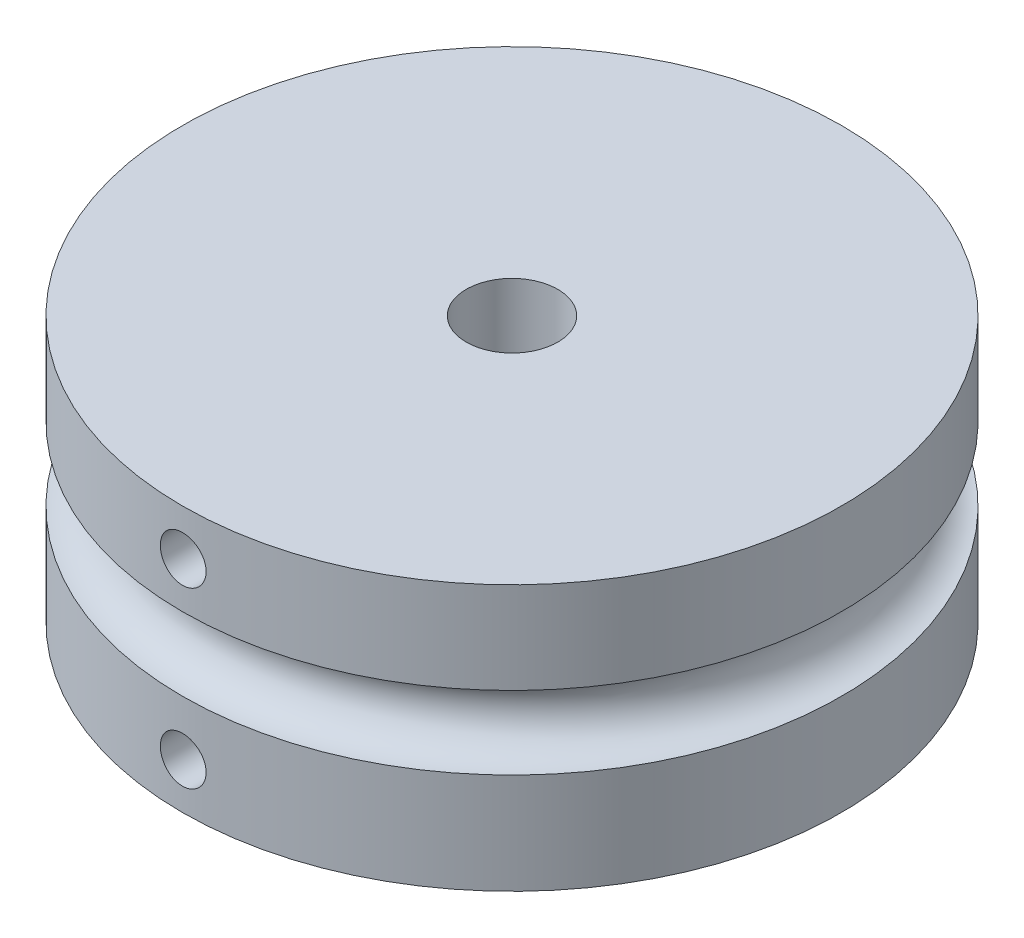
ISO-10303-21;
HEADER;
FILE_DESCRIPTION(('STEP AP214'),'2;1');
FILE_NAME('part.step','',(''),(''),'','','');
FILE_SCHEMA(('AUTOMOTIVE_DESIGN { 1 0 10303 214 1 1 1 1 }'));
ENDSEC;
DATA;
#1=APPLICATION_CONTEXT('core data for automotive mechanical design processes');
#2=APPLICATION_PROTOCOL_DEFINITION('international standard','automotive_design',2000,#1);
#3=PRODUCT_CONTEXT('',#1,'mechanical');
#4=PRODUCT('Part','Part','',(#3));
#5=PRODUCT_RELATED_PRODUCT_CATEGORY('part','',(#4));
#6=PRODUCT_DEFINITION_FORMATION('','',#4);
#7=PRODUCT_DEFINITION_CONTEXT('part definition',#1,'design');
#8=PRODUCT_DEFINITION('design','',#6,#7);
#9=PRODUCT_DEFINITION_SHAPE('','',#8);
#10=(LENGTH_UNIT() NAMED_UNIT(*) SI_UNIT(.MILLI.,.METRE.));
#11=(NAMED_UNIT(*) PLANE_ANGLE_UNIT() SI_UNIT($,.RADIAN.));
#12=(NAMED_UNIT(*) SI_UNIT($,.STERADIAN.) SOLID_ANGLE_UNIT());
#13=UNCERTAINTY_MEASURE_WITH_UNIT(LENGTH_MEASURE(1.E-05),#10,'distance_accuracy_value','');
#14=(GEOMETRIC_REPRESENTATION_CONTEXT(3) GLOBAL_UNCERTAINTY_ASSIGNED_CONTEXT((#13)) GLOBAL_UNIT_ASSIGNED_CONTEXT((#10,
#11,#12)) REPRESENTATION_CONTEXT('',''));
#15=CARTESIAN_POINT('',(0.,0.,0.));
#16=DIRECTION('',(0.,0.,1.));
#17=DIRECTION('',(1.,0.,0.));
#18=AXIS2_PLACEMENT_3D('',#15,#16,#17);
#19=CARTESIAN_POINT('',(0.,7.25,0.));
#20=DIRECTION('',(0.,-1.,0.));
#21=DIRECTION('',(0.,0.,-1.));
#22=AXIS2_PLACEMENT_3D('',#19,#20,#21);
#23=CYLINDRICAL_SURFACE('',#22,18.);
#24=CARTESIAN_POINT('',(0.,3.50000000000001,18.));
#25=CARTESIAN_POINT('',(-0.0701223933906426,3.50000307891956,17.9999994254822));
#26=CARTESIAN_POINT('',(-0.140293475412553,3.50592041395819,17.9995858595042));
#27=CARTESIAN_POINT('',(-0.278696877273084,3.52944024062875,17.9979758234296));
#28=CARTESIAN_POINT('',(-0.346926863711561,3.54705622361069,17.9967784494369));
#29=CARTESIAN_POINT('',(-0.479423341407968,3.59346388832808,17.9937362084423));
#30=CARTESIAN_POINT('',(-0.543691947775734,3.62224954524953,17.9918916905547));
#31=CARTESIAN_POINT('',(-0.666468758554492,3.69016935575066,17.9877624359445));
#32=CARTESIAN_POINT('',(-0.7249782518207,3.7293011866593,17.985477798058));
#33=CARTESIAN_POINT('',(-0.834698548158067,3.8168799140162,17.9807203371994));
#34=CARTESIAN_POINT('',(-0.885897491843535,3.86534165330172,17.9782472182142));
#35=CARTESIAN_POINT('',(-0.979441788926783,3.97017363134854,17.9733940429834));
#36=CARTESIAN_POINT('',(-1.02178676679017,4.02654420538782,17.9710139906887));
#37=CARTESIAN_POINT('',(-1.09645909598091,4.14566271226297,17.9666130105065));
#38=CARTESIAN_POINT('',(-1.1287763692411,4.20841697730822,17.9645924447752));
#39=CARTESIAN_POINT('',(-1.18241148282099,4.33847719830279,17.9611422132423));
#40=CARTESIAN_POINT('',(-1.2037294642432,4.40578309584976,17.9597125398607));
#41=CARTESIAN_POINT('',(-1.23472734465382,4.54291988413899,17.9576081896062));
#42=CARTESIAN_POINT('',(-1.24442612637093,4.61274648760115,17.9569322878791));
#43=CARTESIAN_POINT('',(-1.25196859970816,4.75303960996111,17.9564080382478));
#44=CARTESIAN_POINT('',(-1.24981245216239,4.82350612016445,17.9565596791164));
#45=CARTESIAN_POINT('',(-1.23372191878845,4.9629498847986,17.9576722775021));
#46=CARTESIAN_POINT('',(-1.21980799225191,5.03192951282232,17.9586318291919));
#47=CARTESIAN_POINT('',(-1.18062861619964,5.16657180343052,17.9612499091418));
#48=CARTESIAN_POINT('',(-1.15536308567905,5.2322344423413,17.9629084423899));
#49=CARTESIAN_POINT('',(-1.09417456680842,5.3584444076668,17.9667392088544));
#50=CARTESIAN_POINT('',(-1.05824232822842,5.41898723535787,17.9689118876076));
#51=CARTESIAN_POINT('',(-0.97674706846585,5.533189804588,17.9735256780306));
#52=CARTESIAN_POINT('',(-0.931183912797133,5.58684944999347,17.9759667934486));
#53=CARTESIAN_POINT('',(-0.831605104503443,5.68588146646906,17.9808486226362));
#54=CARTESIAN_POINT('',(-0.777571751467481,5.73123604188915,17.9832893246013));
#55=CARTESIAN_POINT('',(-0.662648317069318,5.81223310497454,17.9878903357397));
#56=CARTESIAN_POINT('',(-0.601758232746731,5.84787558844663,17.9900506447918));
#57=CARTESIAN_POINT('',(-0.474838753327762,5.90843532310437,17.9938476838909));
#58=CARTESIAN_POINT('',(-0.408809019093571,5.93335186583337,17.9954843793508));
#59=CARTESIAN_POINT('',(-0.27348954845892,5.97174037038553,17.9980493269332));
#60=CARTESIAN_POINT('',(-0.204199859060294,5.98521249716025,17.9989775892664));
#61=CARTESIAN_POINT('',(-0.0644817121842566,6.00030761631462,18.0000197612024));
#62=CARTESIAN_POINT('',(0.00594407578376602,6.0019552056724,18.0001353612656));
#63=CARTESIAN_POINT('',(0.146070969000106,5.99341879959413,17.9995436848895));
#64=CARTESIAN_POINT('',(0.215772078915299,5.98323488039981,17.9988364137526));
#65=CARTESIAN_POINT('',(0.352401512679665,5.951344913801,17.9966796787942));
#66=CARTESIAN_POINT('',(0.419332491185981,5.92965018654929,17.9952309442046));
#67=CARTESIAN_POINT('',(0.548603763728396,5.87536595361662,17.991754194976));
#68=CARTESIAN_POINT('',(0.6109440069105,5.84277632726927,17.9897261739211));
#69=CARTESIAN_POINT('',(0.729376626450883,5.76756502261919,17.9853143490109));
#70=CARTESIAN_POINT('',(0.785458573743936,5.72492695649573,17.9829299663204));
#71=CARTESIAN_POINT('',(0.889677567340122,5.63085290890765,17.9780755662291));
#72=CARTESIAN_POINT('',(0.937814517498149,5.57941682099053,17.9756055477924));
#73=CARTESIAN_POINT('',(1.02486072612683,5.46910050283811,17.9708533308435));
#74=CARTESIAN_POINT('',(1.06375399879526,5.41020764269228,17.9685714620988));
#75=CARTESIAN_POINT('',(1.13109939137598,5.28671282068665,17.964458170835));
#76=CARTESIAN_POINT('',(1.15955158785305,5.22211090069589,17.9626267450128));
#77=CARTESIAN_POINT('',(1.2051796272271,5.08908961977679,17.959623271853));
#78=CARTESIAN_POINT('',(1.22236544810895,5.02067369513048,17.9584506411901));
#79=CARTESIAN_POINT('',(1.24500545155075,4.88191895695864,17.9568953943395));
#80=CARTESIAN_POINT('',(1.25045978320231,4.81158016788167,17.956512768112));
#81=CARTESIAN_POINT('',(1.24948046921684,4.6711352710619,17.9565809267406));
#82=CARTESIAN_POINT('',(1.24307194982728,4.60102898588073,17.957029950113));
#83=CARTESIAN_POINT('',(1.21860103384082,4.46289060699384,17.9587070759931));
#84=CARTESIAN_POINT('',(1.20053861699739,4.39485851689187,17.9599351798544));
#85=CARTESIAN_POINT('',(1.15327852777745,4.26279663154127,17.9630316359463));
#86=CARTESIAN_POINT('',(1.12408107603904,4.19876675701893,17.9648999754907));
#87=CARTESIAN_POINT('',(1.05538290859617,4.07651419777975,17.9690663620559));
#88=CARTESIAN_POINT('',(1.01588242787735,4.01829138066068,17.9713643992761));
#89=CARTESIAN_POINT('',(0.927605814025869,3.90917770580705,17.9761369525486));
#90=CARTESIAN_POINT('',(0.878811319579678,3.85830171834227,17.9786118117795));
#91=CARTESIAN_POINT('',(0.77336021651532,3.76544424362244,17.9834561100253));
#92=CARTESIAN_POINT('',(0.716701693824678,3.72346492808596,17.9858255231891));
#93=CARTESIAN_POINT('',(0.597053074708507,3.64955401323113,17.990194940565));
#94=CARTESIAN_POINT('',(0.534054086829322,3.61763679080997,17.9921944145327));
#95=CARTESIAN_POINT('',(0.403622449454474,3.56487259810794,17.9955918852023));
#96=CARTESIAN_POINT('',(0.336195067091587,3.54401273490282,17.9969905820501));
#97=CARTESIAN_POINT('',(0.223632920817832,3.51934426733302,17.9986646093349));
#98=CARTESIAN_POINT('',(0.179224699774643,3.51209962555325,17.999163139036));
#99=CARTESIAN_POINT('',(0.0898843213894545,3.50242650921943,17.9998310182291));
#100=CARTESIAN_POINT('',(0.044952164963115,3.49999802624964,18.0000003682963));
#101=CARTESIAN_POINT('',(0.,3.50000000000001,18.));
#102=B_SPLINE_CURVE_WITH_KNOTS('',3,(#24,#25,#26,#27,#28,#29,#30,#31,#32,#33,#34,#35,#36,#37,
#38,#39,#40,#41,#42,#43,#44,#45,#46,#47,#48,#49,#50,#51,#52,#53,#54,#55,#56,#57,#58,#59,#60,#61,
#62,#63,#64,#65,#66,#67,#68,#69,#70,#71,#72,#73,#74,#75,#76,#77,#78,#79,#80,#81,#82,#83,#84,#85,
#86,#87,#88,#89,#90,#91,#92,#93,#94,#95,#96,#97,#98,#99,#100,#101),.UNSPECIFIED.,.T.,.F.,(4,2,2,
2,2,2,2,2,2,2,2,2,2,2,2,2,2,2,2,2,2,2,2,2,2,2,2,2,2,2,2,2,2,2,2,2,2,2,4),(0.,0.210203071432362,
0.420648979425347,0.630981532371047,0.841266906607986,1.05188962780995,1.26252128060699,
1.47336394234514,1.6842038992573,1.89470074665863,2.10519473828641,2.31532320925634,
2.52545317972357,2.73576591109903,2.94608157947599,3.15684275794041,3.36760402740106,
3.57837921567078,3.78915136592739,3.99948494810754,4.20981717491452,4.41994293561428,
4.6300710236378,4.84054420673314,5.05101993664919,5.26185705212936,5.47269262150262,
5.68334121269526,5.89398712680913,6.10418739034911,6.31438801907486,6.52458448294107,
6.73477615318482,6.94538746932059,7.15605013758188,7.36701245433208,7.57772824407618,
7.71247977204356,7.84723106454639),.UNSPECIFIED.);
#103=CARTESIAN_POINT('',(0.,3.50000000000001,18.));
#104=VERTEX_POINT('',#103);
#105=EDGE_CURVE('E93',#104,#104,#102,.T.);
#106=ORIENTED_EDGE('',*,*,#105,.T.);
#107=EDGE_LOOP('',(#106));
#108=FACE_BOUND('',#107,.T.);
#109=CARTESIAN_POINT('',(0.,2.25,0.));
#110=DIRECTION('',(0.,-1.,0.));
#111=DIRECTION('',(0.,0.,-1.));
#112=AXIS2_PLACEMENT_3D('',#109,#110,#111);
#113=CIRCLE('',#112,18.);
#114=CARTESIAN_POINT('',(0.,2.25,-18.));
#115=VERTEX_POINT('',#114);
#116=EDGE_CURVE('E73',#115,#115,#113,.F.);
#117=ORIENTED_EDGE('',*,*,#116,.T.);
#118=EDGE_LOOP('',(#117));
#119=FACE_BOUND('',#118,.T.);
#120=CARTESIAN_POINT('',(0.,7.25,0.));
#121=DIRECTION('',(0.,1.,0.));
#122=DIRECTION('',(0.,0.,1.));
#123=AXIS2_PLACEMENT_3D('',#120,#121,#122);
#124=CIRCLE('',#123,18.);
#125=CARTESIAN_POINT('',(0.,7.25,18.));
#126=VERTEX_POINT('',#125);
#127=EDGE_CURVE('E60',#126,#126,#124,.T.);
#128=ORIENTED_EDGE('',*,*,#127,.F.);
#129=EDGE_LOOP('',(#128));
#130=FACE_BOUND('',#129,.T.);
#131=ADVANCED_FACE('F47',(#108,#119,#130),#23,.T.);
#132=CARTESIAN_POINT('',(0.,7.25,0.));
#133=DIRECTION('',(0.,1.,0.));
#134=DIRECTION('',(0.,0.,1.));
#135=AXIS2_PLACEMENT_3D('',#132,#133,#134);
#136=PLANE('',#135);
#137=CARTESIAN_POINT('',(0.,7.25,0.));
#138=DIRECTION('',(0.,1.,0.));
#139=DIRECTION('',(0.,0.,1.));
#140=AXIS2_PLACEMENT_3D('',#137,#138,#139);
#141=CIRCLE('',#140,2.5);
#142=CARTESIAN_POINT('',(0.,7.25,2.5));
#143=VERTEX_POINT('',#142);
#144=EDGE_CURVE('E112',#143,#143,#141,.T.);
#145=ORIENTED_EDGE('',*,*,#144,.F.);
#146=EDGE_LOOP('',(#145));
#147=FACE_BOUND('',#146,.T.);
#148=ORIENTED_EDGE('',*,*,#127,.T.);
#149=EDGE_LOOP('',(#148));
#150=FACE_BOUND('',#149,.T.);
#151=ADVANCED_FACE('F137',(#147,#150),#136,.T.);
#152=CARTESIAN_POINT('',(0.,0.249999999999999,0.));
#153=DIRECTION('',(0.,1.,0.));
#154=DIRECTION('',(0.,0.,1.));
#155=AXIS2_PLACEMENT_3D('',#152,#153,#154);
#156=TOROIDAL_SURFACE('',#155,18.,2.);
#157=CARTESIAN_POINT('',(0.,-1.75,0.));
#158=DIRECTION('',(0.,1.,0.));
#159=DIRECTION('',(0.,0.,1.));
#160=AXIS2_PLACEMENT_3D('',#157,#158,#159);
#161=CIRCLE('',#160,18.);
#162=CARTESIAN_POINT('',(0.,-1.75,18.));
#163=VERTEX_POINT('',#162);
#164=EDGE_CURVE('E79',#163,#163,#161,.F.);
#165=ORIENTED_EDGE('',*,*,#164,.F.);
#166=EDGE_LOOP('',(#165));
#167=FACE_BOUND('',#166,.T.);
#168=ORIENTED_EDGE('',*,*,#116,.F.);
#169=EDGE_LOOP('',(#168));
#170=FACE_BOUND('',#169,.T.);
#171=ADVANCED_FACE('F142',(#167,#170),#156,.F.);
#172=CARTESIAN_POINT('',(0.,-7.25,0.));
#173=DIRECTION('',(0.,1.,0.));
#174=DIRECTION('',(0.,0.,1.));
#175=AXIS2_PLACEMENT_3D('',#172,#173,#174);
#176=PLANE('',#175);
#177=CARTESIAN_POINT('',(0.,-7.25,0.));
#178=DIRECTION('',(0.,1.,0.));
#179=DIRECTION('',(0.,0.,1.));
#180=AXIS2_PLACEMENT_3D('',#177,#178,#179);
#181=CIRCLE('',#180,2.5);
#182=CARTESIAN_POINT('',(0.,-7.25,2.5));
#183=VERTEX_POINT('',#182);
#184=EDGE_CURVE('E76',#183,#183,#181,.T.);
#185=ORIENTED_EDGE('',*,*,#184,.T.);
#186=EDGE_LOOP('',(#185));
#187=FACE_BOUND('',#186,.T.);
#188=CARTESIAN_POINT('',(0.,-7.25,0.));
#189=DIRECTION('',(0.,1.,0.));
#190=DIRECTION('',(0.,0.,1.));
#191=AXIS2_PLACEMENT_3D('',#188,#189,#190);
#192=CIRCLE('',#191,18.);
#193=CARTESIAN_POINT('',(0.,-7.25,18.));
#194=VERTEX_POINT('',#193);
#195=EDGE_CURVE('E66',#194,#194,#192,.T.);
#196=ORIENTED_EDGE('',*,*,#195,.F.);
#197=EDGE_LOOP('',(#196));
#198=FACE_BOUND('',#197,.T.);
#199=ADVANCED_FACE('F126',(#187,#198),#176,.F.);
#200=CARTESIAN_POINT('',(0.,-5.99999999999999,18.));
#201=CARTESIAN_POINT('',(-0.0701223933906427,-5.99999692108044,17.9999994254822));
#202=CARTESIAN_POINT('',(-0.140293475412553,-5.99407958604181,17.9995858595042));
#203=CARTESIAN_POINT('',(-0.278696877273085,-5.97055975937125,17.9979758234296));
#204=CARTESIAN_POINT('',(-0.346926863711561,-5.95294377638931,17.9967784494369));
#205=CARTESIAN_POINT('',(-0.479423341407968,-5.90653611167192,17.9937362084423));
#206=CARTESIAN_POINT('',(-0.543691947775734,-5.87775045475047,17.9918916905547));
#207=CARTESIAN_POINT('',(-0.666468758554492,-5.80983064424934,17.9877624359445));
#208=CARTESIAN_POINT('',(-0.7249782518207,-5.7706988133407,17.985477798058));
#209=CARTESIAN_POINT('',(-0.834698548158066,-5.6831200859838,17.9807203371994));
#210=CARTESIAN_POINT('',(-0.885897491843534,-5.63465834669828,17.9782472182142));
#211=CARTESIAN_POINT('',(-0.979441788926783,-5.52982636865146,17.9733940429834));
#212=CARTESIAN_POINT('',(-1.02178676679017,-5.47345579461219,17.9710139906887));
#213=CARTESIAN_POINT('',(-1.09645909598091,-5.35433728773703,17.9666130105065));
#214=CARTESIAN_POINT('',(-1.1287763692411,-5.29158302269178,17.9645924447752));
#215=CARTESIAN_POINT('',(-1.18241148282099,-5.16152280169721,17.9611422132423));
#216=CARTESIAN_POINT('',(-1.2037294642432,-5.09421690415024,17.9597125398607));
#217=CARTESIAN_POINT('',(-1.23472734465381,-4.95708011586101,17.9576081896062));
#218=CARTESIAN_POINT('',(-1.24442612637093,-4.88725351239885,17.9569322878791));
#219=CARTESIAN_POINT('',(-1.25196859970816,-4.74696039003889,17.9564080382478));
#220=CARTESIAN_POINT('',(-1.24981245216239,-4.67649387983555,17.9565596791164));
#221=CARTESIAN_POINT('',(-1.23372191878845,-4.5370501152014,17.9576722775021));
#222=CARTESIAN_POINT('',(-1.21980799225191,-4.46807048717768,17.9586318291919));
#223=CARTESIAN_POINT('',(-1.18062861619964,-4.33342819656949,17.9612499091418));
#224=CARTESIAN_POINT('',(-1.15536308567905,-4.2677655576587,17.9629084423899));
#225=CARTESIAN_POINT('',(-1.09417456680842,-4.1415555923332,17.9667392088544));
#226=CARTESIAN_POINT('',(-1.05824232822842,-4.08101276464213,17.9689118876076));
#227=CARTESIAN_POINT('',(-0.97674706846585,-3.966810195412,17.9735256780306));
#228=CARTESIAN_POINT('',(-0.931183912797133,-3.91315055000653,17.9759667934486));
#229=CARTESIAN_POINT('',(-0.831605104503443,-3.81411853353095,17.9808486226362));
#230=CARTESIAN_POINT('',(-0.777571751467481,-3.76876395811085,17.9832893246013));
#231=CARTESIAN_POINT('',(-0.662648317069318,-3.68776689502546,17.9878903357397));
#232=CARTESIAN_POINT('',(-0.601758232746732,-3.65212441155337,17.9900506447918));
#233=CARTESIAN_POINT('',(-0.474838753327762,-3.59156467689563,17.9938476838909));
#234=CARTESIAN_POINT('',(-0.408809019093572,-3.56664813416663,17.9954843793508));
#235=CARTESIAN_POINT('',(-0.27348954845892,-3.52825962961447,17.9980493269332));
#236=CARTESIAN_POINT('',(-0.204199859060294,-3.51478750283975,17.9989775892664));
#237=CARTESIAN_POINT('',(-0.0644817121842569,-3.49969238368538,18.0000197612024));
#238=CARTESIAN_POINT('',(0.00594407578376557,-3.4980447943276,18.0001353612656));
#239=CARTESIAN_POINT('',(0.146070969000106,-3.50658120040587,17.9995436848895));
#240=CARTESIAN_POINT('',(0.215772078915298,-3.51676511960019,17.9988364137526));
#241=CARTESIAN_POINT('',(0.352401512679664,-3.548655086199,17.9966796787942));
#242=CARTESIAN_POINT('',(0.41933249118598,-3.57034981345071,17.9952309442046));
#243=CARTESIAN_POINT('',(0.548603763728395,-3.62463404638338,17.991754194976));
#244=CARTESIAN_POINT('',(0.610944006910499,-3.65722367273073,17.9897261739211));
#245=CARTESIAN_POINT('',(0.729376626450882,-3.73243497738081,17.9853143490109));
#246=CARTESIAN_POINT('',(0.785458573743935,-3.77507304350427,17.9829299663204));
#247=CARTESIAN_POINT('',(0.889677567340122,-3.86914709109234,17.9780755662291));
#248=CARTESIAN_POINT('',(0.937814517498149,-3.92058317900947,17.9756055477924));
#249=CARTESIAN_POINT('',(1.02486072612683,-4.03089949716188,17.9708533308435));
#250=CARTESIAN_POINT('',(1.06375399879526,-4.08979235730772,17.9685714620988));
#251=CARTESIAN_POINT('',(1.13109939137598,-4.21328717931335,17.964458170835));
#252=CARTESIAN_POINT('',(1.15955158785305,-4.2778890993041,17.9626267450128));
#253=CARTESIAN_POINT('',(1.2051796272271,-4.4109103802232,17.959623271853));
#254=CARTESIAN_POINT('',(1.22236544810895,-4.47932630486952,17.9584506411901));
#255=CARTESIAN_POINT('',(1.24500545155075,-4.61808104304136,17.9568953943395));
#256=CARTESIAN_POINT('',(1.25045978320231,-4.68841983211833,17.956512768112));
#257=CARTESIAN_POINT('',(1.24948046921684,-4.8288647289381,17.9565809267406));
#258=CARTESIAN_POINT('',(1.24307194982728,-4.89897101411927,17.957029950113));
#259=CARTESIAN_POINT('',(1.21860103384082,-5.03710939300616,17.9587070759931));
#260=CARTESIAN_POINT('',(1.20053861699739,-5.10514148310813,17.9599351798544));
#261=CARTESIAN_POINT('',(1.15327852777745,-5.23720336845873,17.9630316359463));
#262=CARTESIAN_POINT('',(1.12408107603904,-5.30123324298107,17.9648999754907));
#263=CARTESIAN_POINT('',(1.05538290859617,-5.42348580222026,17.9690663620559));
#264=CARTESIAN_POINT('',(1.01588242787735,-5.48170861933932,17.9713643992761));
#265=CARTESIAN_POINT('',(0.927605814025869,-5.59082229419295,17.9761369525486));
#266=CARTESIAN_POINT('',(0.878811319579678,-5.64169828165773,17.9786118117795));
#267=CARTESIAN_POINT('',(0.77336021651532,-5.73455575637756,17.9834561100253));
#268=CARTESIAN_POINT('',(0.716701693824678,-5.77653507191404,17.9858255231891));
#269=CARTESIAN_POINT('',(0.597053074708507,-5.85044598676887,17.990194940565));
#270=CARTESIAN_POINT('',(0.534054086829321,-5.88236320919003,17.9921944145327));
#271=CARTESIAN_POINT('',(0.403622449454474,-5.93512740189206,17.9955918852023));
#272=CARTESIAN_POINT('',(0.336195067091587,-5.95598726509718,17.9969905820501));
#273=CARTESIAN_POINT('',(0.223632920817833,-5.98065573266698,17.9986646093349));
#274=CARTESIAN_POINT('',(0.179224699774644,-5.98790037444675,17.999163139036));
#275=CARTESIAN_POINT('',(0.089884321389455,-5.99757349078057,17.9998310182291));
#276=CARTESIAN_POINT('',(0.0449521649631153,-6.00000197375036,18.0000003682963));
#277=CARTESIAN_POINT('',(0.,-5.99999999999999,18.));
#278=B_SPLINE_CURVE_WITH_KNOTS('',3,(#200,#201,#202,#203,#204,#205,#206,#207,#208,#209,#210,
#211,#212,#213,#214,#215,#216,#217,#218,#219,#220,#221,#222,#223,#224,#225,#226,#227,#228,#229,
#230,#231,#232,#233,#234,#235,#236,#237,#238,#239,#240,#241,#242,#243,#244,#245,#246,#247,#248,
#249,#250,#251,#252,#253,#254,#255,#256,#257,#258,#259,#260,#261,#262,#263,#264,#265,#266,#267,
#268,#269,#270,#271,#272,#273,#274,#275,#276,#277),.UNSPECIFIED.,.T.,.F.,(4,2,2,2,2,2,2,2,2,2,2,
2,2,2,2,2,2,2,2,2,2,2,2,2,2,2,2,2,2,2,2,2,2,2,2,2,2,2,4),(0.,0.210203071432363,
0.420648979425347,0.630981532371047,0.841266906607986,1.05188962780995,1.26252128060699,
1.47336394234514,1.6842038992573,1.89470074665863,2.10519473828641,2.31532320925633,
2.52545317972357,2.73576591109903,2.94608157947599,3.15684275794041,3.36760402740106,
3.57837921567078,3.78915136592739,3.99948494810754,4.20981717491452,4.41994293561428,
4.6300710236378,4.84054420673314,5.05101993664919,5.26185705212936,5.47269262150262,
5.68334121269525,5.89398712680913,6.10418739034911,6.31438801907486,6.52458448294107,
6.73477615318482,6.94538746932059,7.15605013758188,7.36701245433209,7.57772824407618,
7.71247977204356,7.84723106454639),.UNSPECIFIED.);
#279=CARTESIAN_POINT('',(0.,-5.99999999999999,18.));
#280=VERTEX_POINT('',#279);
#281=EDGE_CURVE('E10',#280,#280,#278,.T.);
#282=ORIENTED_EDGE('',*,*,#281,.T.);
#283=EDGE_LOOP('',(#282));
#284=FACE_BOUND('',#283,.T.);
#285=ORIENTED_EDGE('',*,*,#164,.T.);
#286=EDGE_LOOP('',(#285));
#287=FACE_BOUND('',#286,.T.);
#288=ORIENTED_EDGE('',*,*,#195,.T.);
#289=EDGE_LOOP('',(#288));
#290=FACE_BOUND('',#289,.T.);
#291=ADVANCED_FACE('F49',(#284,#287,#290),#23,.T.);
#292=CARTESIAN_POINT('',(0.,7.25,0.));
#293=DIRECTION('',(0.,1.,0.));
#294=DIRECTION('',(0.,0.,1.));
#295=AXIS2_PLACEMENT_3D('',#292,#293,#294);
#296=CYLINDRICAL_SURFACE('',#295,2.5);
#297=CARTESIAN_POINT('',(0.,-5.99999999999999,2.5));
#298=CARTESIAN_POINT('',(0.0657149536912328,-5.99999587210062,2.49999641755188));
#299=CARTESIAN_POINT('',(0.13150824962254,-5.9947874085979,2.49738113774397));
#300=CARTESIAN_POINT('',(0.26115029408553,-5.97418389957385,2.48717695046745));
#301=CARTESIAN_POINT('',(0.324995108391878,-5.95876950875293,2.47957859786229));
#302=CARTESIAN_POINT('',(0.448666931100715,-5.918507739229,2.46020349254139));
#303=CARTESIAN_POINT('',(0.508508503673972,-5.89369701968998,2.448442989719));
#304=CARTESIAN_POINT('',(0.623090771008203,-5.83553672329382,2.42182220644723));
#305=CARTESIAN_POINT('',(0.677831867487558,-5.80218781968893,2.40696217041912));
#306=CARTESIAN_POINT('',(0.784384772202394,-5.72560343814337,2.37445322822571));
#307=CARTESIAN_POINT('',(0.835819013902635,-5.68189190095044,2.3566899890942));
#308=CARTESIAN_POINT('',(0.930974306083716,-5.5868481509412,2.3207496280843));
#309=CARTESIAN_POINT('',(0.974689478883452,-5.53551018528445,2.30257220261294));
#310=CARTESIAN_POINT('',(1.05656500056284,-5.42189581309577,2.26623688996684));
#311=CARTESIAN_POINT('',(1.09403166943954,-5.35907987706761,2.24818983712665));
#312=CARTESIAN_POINT('',(1.15771028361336,-5.22704083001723,2.21607473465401));
#313=CARTESIAN_POINT('',(1.18393026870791,-5.15782233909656,2.20200384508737));
#314=CARTESIAN_POINT('',(1.22266555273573,-5.0191686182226,2.18072333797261));
#315=CARTESIAN_POINT('',(1.23590732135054,-4.94999443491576,2.17315339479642));
#316=CARTESIAN_POINT('',(1.25053374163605,-4.81002645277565,2.1647736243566));
#317=CARTESIAN_POINT('',(1.25193011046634,-4.73923432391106,2.1639571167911));
#318=CARTESIAN_POINT('',(1.24335910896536,-4.60714246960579,2.16888662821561));
#319=CARTESIAN_POINT('',(1.23473069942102,-4.54571996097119,2.17385954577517));
#320=CARTESIAN_POINT('',(1.20867481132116,-4.4253476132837,2.18845285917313));
#321=CARTESIAN_POINT('',(1.19124452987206,-4.36639856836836,2.1980747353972));
#322=CARTESIAN_POINT('',(1.1477622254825,-4.25096358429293,2.22109345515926));
#323=CARTESIAN_POINT('',(1.12151883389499,-4.19456700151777,2.23457300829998));
#324=CARTESIAN_POINT('',(1.061302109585,-4.08670713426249,2.26379255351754));
#325=CARTESIAN_POINT('',(1.02732530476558,-4.03524608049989,2.27953355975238));
#326=CARTESIAN_POINT('',(0.94758256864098,-3.93184843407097,2.31391447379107));
#327=CARTESIAN_POINT('',(0.900868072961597,-3.88067890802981,2.33266887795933));
#328=CARTESIAN_POINT('',(0.799444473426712,-3.78658072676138,2.36934529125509));
#329=CARTESIAN_POINT('',(0.744731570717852,-3.74365600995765,2.38726689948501));
#330=CARTESIAN_POINT('',(0.625645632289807,-3.66539292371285,2.42127484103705));
#331=CARTESIAN_POINT('',(0.560941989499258,-3.63049940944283,2.43723730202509));
#332=CARTESIAN_POINT('',(0.425582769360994,-3.57237871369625,2.46447351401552));
#333=CARTESIAN_POINT('',(0.354931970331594,-3.54914226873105,2.47575098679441));
#334=CARTESIAN_POINT('',(0.215958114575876,-3.51690574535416,2.49155417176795));
#335=CARTESIAN_POINT('',(0.147926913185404,-3.50688595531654,2.49656172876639));
#336=CARTESIAN_POINT('',(0.0109744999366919,-3.4981690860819,2.50091266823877));
#337=CARTESIAN_POINT('',(-0.0579462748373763,-3.49946664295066,2.5002587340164));
#338=CARTESIAN_POINT('',(-0.189041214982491,-3.51275836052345,2.49363990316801));
#339=CARTESIAN_POINT('',(-0.251324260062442,-3.52391566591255,2.48809057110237));
#340=CARTESIAN_POINT('',(-0.373008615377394,-3.55529758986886,2.47277714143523));
#341=CARTESIAN_POINT('',(-0.432409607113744,-3.57552320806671,2.46301257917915));
#342=CARTESIAN_POINT('',(-0.548610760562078,-3.62499808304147,2.43980314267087));
#343=CARTESIAN_POINT('',(-0.605287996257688,-3.65448881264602,2.42626102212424));
#344=CARTESIAN_POINT('',(-0.713076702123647,-3.72138441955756,2.39679967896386));
#345=CARTESIAN_POINT('',(-0.764185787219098,-3.7587926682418,2.38087944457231));
#346=CARTESIAN_POINT('',(-0.864709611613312,-3.8447005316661,2.3463527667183));
#347=CARTESIAN_POINT('',(-0.913465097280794,-3.89392858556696,2.32763606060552));
#348=CARTESIAN_POINT('',(-1.00232040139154,-3.99990643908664,2.29077989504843));
#349=CARTESIAN_POINT('',(-1.04241423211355,-4.05666139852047,2.27264084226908));
#350=CARTESIAN_POINT('',(-1.11463489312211,-4.17955456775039,2.23813990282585));
#351=CARTESIAN_POINT('',(-1.14628186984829,-4.24601408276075,2.2219066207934));
#352=CARTESIAN_POINT('',(-1.19760353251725,-4.38438758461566,2.19467590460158));
#353=CARTESIAN_POINT('',(-1.21729364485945,-4.45629440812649,2.18367172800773));
#354=CARTESIAN_POINT('',(-1.24232710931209,-4.59613777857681,2.16951876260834));
#355=CARTESIAN_POINT('',(-1.24886624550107,-4.6637928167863,2.16571729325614));
#356=CARTESIAN_POINT('',(-1.25086144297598,-4.79930883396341,2.16456693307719));
#357=CARTESIAN_POINT('',(-1.24632230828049,-4.86716971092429,2.16721524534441));
#358=CARTESIAN_POINT('',(-1.22740765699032,-4.99435437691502,2.17797327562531));
#359=CARTESIAN_POINT('',(-1.21401039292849,-5.0538755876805,2.18553868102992));
#360=CARTESIAN_POINT('',(-1.1789691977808,-5.16976014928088,2.20463770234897));
#361=CARTESIAN_POINT('',(-1.15732261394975,-5.22612247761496,2.21617259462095));
#362=CARTESIAN_POINT('',(-1.10476968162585,-5.33828106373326,2.2428566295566));
#363=CARTESIAN_POINT('',(-1.07333892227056,-5.39378487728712,2.25819652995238));
#364=CARTESIAN_POINT('',(-1.00268871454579,-5.49909317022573,2.29044164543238));
#365=CARTESIAN_POINT('',(-0.963465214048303,-5.54889466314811,2.30734767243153));
#366=CARTESIAN_POINT('',(-0.872754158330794,-5.64767747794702,2.34327903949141));
#367=CARTESIAN_POINT('',(-0.820355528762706,-5.6958238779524,2.36231229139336));
#368=CARTESIAN_POINT('',(-0.707693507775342,-5.78282872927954,2.3984719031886));
#369=CARTESIAN_POINT('',(-0.647425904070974,-5.82168217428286,2.4155972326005));
#370=CARTESIAN_POINT('',(-0.519914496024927,-5.88904545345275,2.44622511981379));
#371=CARTESIAN_POINT('',(-0.452624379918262,-5.91748021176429,2.45970120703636));
#372=CARTESIAN_POINT('',(-0.313427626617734,-5.96226020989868,2.48126676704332));
#373=CARTESIAN_POINT('',(-0.241534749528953,-5.97863980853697,2.48937154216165));
#374=CARTESIAN_POINT('',(-0.140752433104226,-5.9923717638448,2.49619327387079));
#375=CARTESIAN_POINT('',(-0.112702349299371,-5.99522830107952,2.49761706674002));
#376=CARTESIAN_POINT('',(-0.056439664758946,-5.999043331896,2.49952121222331));
#377=CARTESIAN_POINT('',(-0.0282270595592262,-6.00000177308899,2.50000153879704));
#378=CARTESIAN_POINT('',(0.,-5.99999999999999,2.5));
#379=B_SPLINE_CURVE_WITH_KNOTS('',3,(#297,#298,#299,#300,#301,#302,#303,#304,#305,#306,#307,
#308,#309,#310,#311,#312,#313,#314,#315,#316,#317,#318,#319,#320,#321,#322,#323,#324,#325,#326,
#327,#328,#329,#330,#331,#332,#333,#334,#335,#336,#337,#338,#339,#340,#341,#342,#343,#344,#345,
#346,#347,#348,#349,#350,#351,#352,#353,#354,#355,#356,#357,#358,#359,#360,#361,#362,#363,#364,
#365,#366,#367,#368,#369,#370,#371,#372,#373,#374,#375,#376,#377,#378),.UNSPECIFIED.,.T.,.F.,(4,
2,2,2,2,2,2,2,2,2,2,2,2,2,2,2,2,2,2,2,2,2,2,2,2,2,2,2,2,2,2,2,2,2,2,2,2,2,2,2,4),(0.,
0.197030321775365,0.394435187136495,0.59107769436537,0.787704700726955,0.996227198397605,
1.20490779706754,1.4297715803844,1.6544743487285,1.86572515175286,2.07676696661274,
2.26257140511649,2.44843504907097,2.63862800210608,2.82890651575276,3.04331176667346,
3.25781918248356,3.48228777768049,3.70657771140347,3.9122911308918,4.11790705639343,
4.3075863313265,4.49728652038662,4.6924107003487,4.88761813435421,5.10199513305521,
5.31651985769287,5.54143352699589,5.76605639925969,5.96911634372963,6.17208824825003,
6.35572412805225,6.53941910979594,6.73545570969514,6.93159451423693,7.15156553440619,
7.37165479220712,7.59330017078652,7.81431135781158,7.89894100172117,7.98357298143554),.UNSPECIFIED.);
#380=CARTESIAN_POINT('',(0.,-5.99999999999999,2.5));
#381=VERTEX_POINT('',#380);
#382=EDGE_CURVE('E94',#381,#381,#379,.T.);
#383=ORIENTED_EDGE('',*,*,#382,.T.);
#384=EDGE_LOOP('',(#383));
#385=FACE_BOUND('',#384,.T.);
#386=CARTESIAN_POINT('',(0.,3.50000000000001,2.5));
#387=CARTESIAN_POINT('',(0.0657149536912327,3.50000412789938,2.49999641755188));
#388=CARTESIAN_POINT('',(0.13150824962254,3.5052125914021,2.49738113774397));
#389=CARTESIAN_POINT('',(0.26115029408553,3.52581610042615,2.48717695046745));
#390=CARTESIAN_POINT('',(0.324995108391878,3.54123049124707,2.47957859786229));
#391=CARTESIAN_POINT('',(0.448666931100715,3.581492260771,2.46020349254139));
#392=CARTESIAN_POINT('',(0.508508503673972,3.60630298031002,2.448442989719));
#393=CARTESIAN_POINT('',(0.623090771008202,3.66446327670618,2.42182220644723));
#394=CARTESIAN_POINT('',(0.677831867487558,3.69781218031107,2.40696217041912));
#395=CARTESIAN_POINT('',(0.784384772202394,3.77439656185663,2.37445322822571));
#396=CARTESIAN_POINT('',(0.835819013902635,3.81810809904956,2.3566899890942));
#397=CARTESIAN_POINT('',(0.930974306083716,3.9131518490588,2.3207496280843));
#398=CARTESIAN_POINT('',(0.974689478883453,3.96448981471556,2.30257220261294));
#399=CARTESIAN_POINT('',(1.05656500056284,4.07810418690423,2.26623688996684));
#400=CARTESIAN_POINT('',(1.09403166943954,4.1409201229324,2.24818983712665));
#401=CARTESIAN_POINT('',(1.15771028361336,4.27295916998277,2.21607473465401));
#402=CARTESIAN_POINT('',(1.18393026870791,4.34217766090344,2.20200384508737));
#403=CARTESIAN_POINT('',(1.22266555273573,4.48083138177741,2.18072333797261));
#404=CARTESIAN_POINT('',(1.23590732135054,4.55000556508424,2.17315339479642));
#405=CARTESIAN_POINT('',(1.25053374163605,4.68997354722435,2.1647736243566));
#406=CARTESIAN_POINT('',(1.25193011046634,4.76076567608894,2.1639571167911));
#407=CARTESIAN_POINT('',(1.24335910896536,4.89285753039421,2.16888662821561));
#408=CARTESIAN_POINT('',(1.23473069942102,4.95428003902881,2.17385954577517));
#409=CARTESIAN_POINT('',(1.20867481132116,5.0746523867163,2.18845285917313));
#410=CARTESIAN_POINT('',(1.19124452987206,5.13360143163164,2.1980747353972));
#411=CARTESIAN_POINT('',(1.1477622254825,5.24903641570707,2.22109345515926));
#412=CARTESIAN_POINT('',(1.12151883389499,5.30543299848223,2.23457300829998));
#413=CARTESIAN_POINT('',(1.061302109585,5.41329286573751,2.26379255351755));
#414=CARTESIAN_POINT('',(1.02732530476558,5.46475391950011,2.27953355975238));
#415=CARTESIAN_POINT('',(0.94758256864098,5.56815156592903,2.31391447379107));
#416=CARTESIAN_POINT('',(0.900868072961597,5.61932109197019,2.33266887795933));
#417=CARTESIAN_POINT('',(0.799444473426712,5.71341927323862,2.36934529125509));
#418=CARTESIAN_POINT('',(0.744731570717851,5.75634399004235,2.38726689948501));
#419=CARTESIAN_POINT('',(0.625645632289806,5.83460707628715,2.42127484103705));
#420=CARTESIAN_POINT('',(0.560941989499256,5.86950059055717,2.43723730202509));
#421=CARTESIAN_POINT('',(0.425582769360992,5.92762128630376,2.46447351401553));
#422=CARTESIAN_POINT('',(0.354931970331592,5.95085773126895,2.47575098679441));
#423=CARTESIAN_POINT('',(0.215958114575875,5.98309425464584,2.49155417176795));
#424=CARTESIAN_POINT('',(0.147926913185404,5.99311404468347,2.49656172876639));
#425=CARTESIAN_POINT('',(0.0109744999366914,6.00183091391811,2.50091266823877));
#426=CARTESIAN_POINT('',(-0.0579462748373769,6.00053335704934,2.5002587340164));
#427=CARTESIAN_POINT('',(-0.189041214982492,5.98724163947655,2.49363990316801));
#428=CARTESIAN_POINT('',(-0.251324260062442,5.97608433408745,2.48809057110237));
#429=CARTESIAN_POINT('',(-0.373008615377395,5.94470241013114,2.47277714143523));
#430=CARTESIAN_POINT('',(-0.432409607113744,5.92447679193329,2.46301257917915));
#431=CARTESIAN_POINT('',(-0.548610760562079,5.87500191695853,2.43980314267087));
#432=CARTESIAN_POINT('',(-0.605287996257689,5.84551118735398,2.42626102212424));
#433=CARTESIAN_POINT('',(-0.713076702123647,5.77861558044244,2.39679967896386));
#434=CARTESIAN_POINT('',(-0.764185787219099,5.74120733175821,2.38087944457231));
#435=CARTESIAN_POINT('',(-0.864709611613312,5.6552994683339,2.3463527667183));
#436=CARTESIAN_POINT('',(-0.913465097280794,5.60607141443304,2.32763606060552));
#437=CARTESIAN_POINT('',(-1.00232040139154,5.50009356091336,2.29077989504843));
#438=CARTESIAN_POINT('',(-1.04241423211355,5.44333860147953,2.27264084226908));
#439=CARTESIAN_POINT('',(-1.11463489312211,5.32044543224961,2.23813990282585));
#440=CARTESIAN_POINT('',(-1.14628186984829,5.25398591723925,2.2219066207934));
#441=CARTESIAN_POINT('',(-1.19760353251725,5.11561241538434,2.19467590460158));
#442=CARTESIAN_POINT('',(-1.21729364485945,5.04370559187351,2.18367172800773));
#443=CARTESIAN_POINT('',(-1.24232710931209,4.90386222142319,2.16951876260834));
#444=CARTESIAN_POINT('',(-1.24886624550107,4.8362071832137,2.16571729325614));
#445=CARTESIAN_POINT('',(-1.25086144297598,4.70069116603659,2.16456693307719));
#446=CARTESIAN_POINT('',(-1.24632230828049,4.63283028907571,2.16721524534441));
#447=CARTESIAN_POINT('',(-1.22740765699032,4.50564562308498,2.17797327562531));
#448=CARTESIAN_POINT('',(-1.21401039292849,4.4461244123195,2.18553868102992));
#449=CARTESIAN_POINT('',(-1.1789691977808,4.33023985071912,2.20463770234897));
#450=CARTESIAN_POINT('',(-1.15732261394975,4.27387752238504,2.21617259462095));
#451=CARTESIAN_POINT('',(-1.10476968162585,4.16171893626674,2.2428566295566));
#452=CARTESIAN_POINT('',(-1.07333892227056,4.10621512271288,2.25819652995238));
#453=CARTESIAN_POINT('',(-1.00268871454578,4.00090682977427,2.29044164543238));
#454=CARTESIAN_POINT('',(-0.963465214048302,3.95110533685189,2.30734767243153));
#455=CARTESIAN_POINT('',(-0.872754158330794,3.85232252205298,2.34327903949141));
#456=CARTESIAN_POINT('',(-0.820355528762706,3.8041761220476,2.36231229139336));
#457=CARTESIAN_POINT('',(-0.707693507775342,3.71717127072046,2.3984719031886));
#458=CARTESIAN_POINT('',(-0.647425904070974,3.67831782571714,2.4155972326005));
#459=CARTESIAN_POINT('',(-0.519914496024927,3.61095454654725,2.44622511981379));
#460=CARTESIAN_POINT('',(-0.452624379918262,3.58251978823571,2.45970120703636));
#461=CARTESIAN_POINT('',(-0.313427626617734,3.53773979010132,2.48126676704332));
#462=CARTESIAN_POINT('',(-0.241534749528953,3.52136019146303,2.48937154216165));
#463=CARTESIAN_POINT('',(-0.140752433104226,3.5076282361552,2.49619327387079));
#464=CARTESIAN_POINT('',(-0.112702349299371,3.50477169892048,2.49761706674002));
#465=CARTESIAN_POINT('',(-0.0564396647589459,3.500956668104,2.49952121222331));
#466=CARTESIAN_POINT('',(-0.0282270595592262,3.49999822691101,2.50000153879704));
#467=CARTESIAN_POINT('',(0.,3.50000000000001,2.5));
#468=B_SPLINE_CURVE_WITH_KNOTS('',3,(#386,#387,#388,#389,#390,#391,#392,#393,#394,#395,#396,
#397,#398,#399,#400,#401,#402,#403,#404,#405,#406,#407,#408,#409,#410,#411,#412,#413,#414,#415,
#416,#417,#418,#419,#420,#421,#422,#423,#424,#425,#426,#427,#428,#429,#430,#431,#432,#433,#434,
#435,#436,#437,#438,#439,#440,#441,#442,#443,#444,#445,#446,#447,#448,#449,#450,#451,#452,#453,
#454,#455,#456,#457,#458,#459,#460,#461,#462,#463,#464,#465,#466,#467),.UNSPECIFIED.,.T.,.F.,(4,
2,2,2,2,2,2,2,2,2,2,2,2,2,2,2,2,2,2,2,2,2,2,2,2,2,2,2,2,2,2,2,2,2,2,2,2,2,2,2,4),(0.,
0.197030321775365,0.394435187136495,0.591077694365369,0.787704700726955,0.996227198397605,
1.20490779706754,1.4297715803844,1.6544743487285,1.86572515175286,2.07676696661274,
2.26257140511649,2.44843504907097,2.63862800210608,2.82890651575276,3.04331176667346,
3.25781918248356,3.48228777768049,3.70657771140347,3.9122911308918,4.11790705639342,
4.3075863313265,4.49728652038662,4.6924107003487,4.88761813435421,5.10199513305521,
5.31651985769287,5.54143352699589,5.76605639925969,5.96911634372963,6.17208824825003,
6.35572412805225,6.53941910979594,6.73545570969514,6.93159451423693,7.15156553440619,
7.37165479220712,7.59330017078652,7.81431135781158,7.89894100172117,7.98357298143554),.UNSPECIFIED.);
#469=CARTESIAN_POINT('',(0.,3.50000000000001,2.5));
#470=VERTEX_POINT('',#469);
#471=EDGE_CURVE('E85',#470,#470,#468,.T.);
#472=ORIENTED_EDGE('',*,*,#471,.T.);
#473=EDGE_LOOP('',(#472));
#474=FACE_BOUND('',#473,.T.);
#475=ORIENTED_EDGE('',*,*,#184,.F.);
#476=EDGE_LOOP('',(#475));
#477=FACE_BOUND('',#476,.T.);
#478=ORIENTED_EDGE('',*,*,#144,.T.);
#479=EDGE_LOOP('',(#478));
#480=FACE_BOUND('',#479,.T.);
#481=ADVANCED_FACE('F95',(#385,#474,#477,#480),#296,.F.);
#482=CARTESIAN_POINT('',(0.,4.75,18.));
#483=DIRECTION('',(0.,0.,1.));
#484=DIRECTION('',(0.,-1.,0.));
#485=AXIS2_PLACEMENT_3D('',#482,#483,#484);
#486=CYLINDRICAL_SURFACE('',#485,1.24999999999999);
#487=ORIENTED_EDGE('',*,*,#471,.F.);
#488=EDGE_LOOP('',(#487));
#489=FACE_BOUND('',#488,.T.);
#490=ORIENTED_EDGE('',*,*,#105,.F.);
#491=EDGE_LOOP('',(#490));
#492=FACE_BOUND('',#491,.T.);
#493=ADVANCED_FACE('F98',(#489,#492),#486,.F.);
#494=CARTESIAN_POINT('',(0.,-4.75,18.));
#495=DIRECTION('',(0.,0.,1.));
#496=DIRECTION('',(0.,-1.,0.));
#497=AXIS2_PLACEMENT_3D('',#494,#495,#496);
#498=CYLINDRICAL_SURFACE('',#497,1.24999999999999);
#499=ORIENTED_EDGE('',*,*,#281,.F.);
#500=EDGE_LOOP('',(#499));
#501=FACE_BOUND('',#500,.T.);
#502=ORIENTED_EDGE('',*,*,#382,.F.);
#503=EDGE_LOOP('',(#502));
#504=FACE_BOUND('',#503,.T.);
#505=ADVANCED_FACE('F101',(#501,#504),#498,.F.);
#506=CLOSED_SHELL('',(#131,#151,#171,#199,#291,#481,#493,#505));
#507=MANIFOLD_SOLID_BREP('B2',#506);
#508=ADVANCED_BREP_SHAPE_REPRESENTATION('',(#18,#507),#14);
#509=SHAPE_DEFINITION_REPRESENTATION(#9,#508);
ENDSEC;
END-ISO-10303-21;
